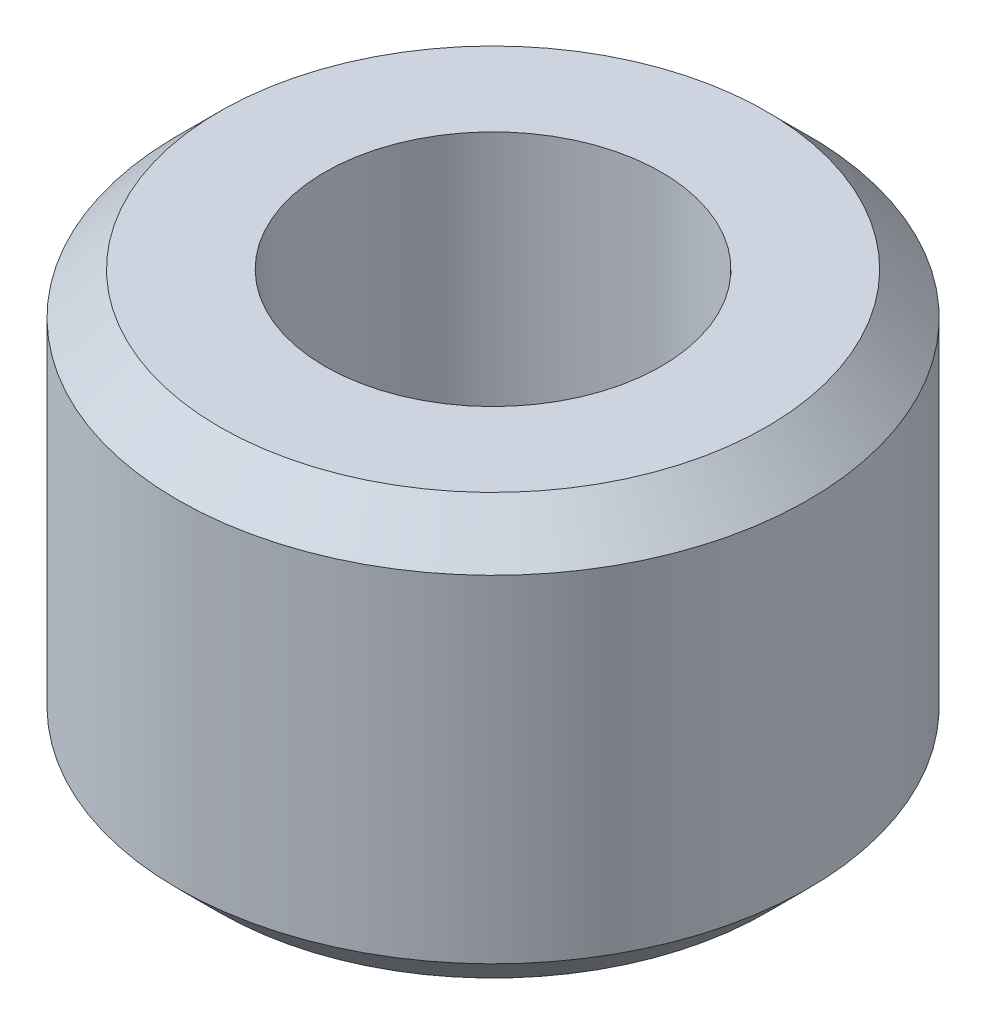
ISO-10303-21;
HEADER;
FILE_DESCRIPTION(('STEP AP214'),'2;1');
FILE_NAME('part.step','',(''),(''),'','','');
FILE_SCHEMA(('AUTOMOTIVE_DESIGN { 1 0 10303 214 1 1 1 1 }'));
ENDSEC;
DATA;
#1=APPLICATION_CONTEXT('core data for automotive mechanical design processes');
#2=APPLICATION_PROTOCOL_DEFINITION('international standard','automotive_design',2000,#1);
#3=PRODUCT_CONTEXT('',#1,'mechanical');
#4=PRODUCT('Part','Part','',(#3));
#5=PRODUCT_RELATED_PRODUCT_CATEGORY('part','',(#4));
#6=PRODUCT_DEFINITION_FORMATION('','',#4);
#7=PRODUCT_DEFINITION_CONTEXT('part definition',#1,'design');
#8=PRODUCT_DEFINITION('design','',#6,#7);
#9=PRODUCT_DEFINITION_SHAPE('','',#8);
#10=(LENGTH_UNIT() NAMED_UNIT(*) SI_UNIT(.MILLI.,.METRE.));
#11=(NAMED_UNIT(*) PLANE_ANGLE_UNIT() SI_UNIT($,.RADIAN.));
#12=(NAMED_UNIT(*) SI_UNIT($,.STERADIAN.) SOLID_ANGLE_UNIT());
#13=UNCERTAINTY_MEASURE_WITH_UNIT(LENGTH_MEASURE(1.E-05),#10,'distance_accuracy_value','');
#14=(GEOMETRIC_REPRESENTATION_CONTEXT(3) GLOBAL_UNCERTAINTY_ASSIGNED_CONTEXT((#13)) GLOBAL_UNIT_ASSIGNED_CONTEXT((#10,
#11,#12)) REPRESENTATION_CONTEXT('',''));
#15=CARTESIAN_POINT('',(0.,0.,0.));
#16=DIRECTION('',(0.,0.,1.));
#17=DIRECTION('',(1.,0.,0.));
#18=AXIS2_PLACEMENT_3D('',#15,#16,#17);
#19=CARTESIAN_POINT('',(0.,10.,0.));
#20=DIRECTION('',(0.,1.,0.));
#21=DIRECTION('',(0.,0.,1.));
#22=AXIS2_PLACEMENT_3D('',#19,#20,#21);
#23=PLANE('',#22);
#24=CARTESIAN_POINT('',(0.,10.,0.));
#25=DIRECTION('',(0.,1.,0.));
#26=DIRECTION('',(0.,0.,1.));
#27=AXIS2_PLACEMENT_3D('',#24,#25,#26);
#28=CIRCLE('',#27,6.49999999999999);
#29=CARTESIAN_POINT('',(0.,10.,6.49999999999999));
#30=VERTEX_POINT('',#29);
#31=EDGE_CURVE('E10',#30,#30,#28,.T.);
#32=ORIENTED_EDGE('',*,*,#31,.T.);
#33=EDGE_LOOP('',(#32));
#34=FACE_BOUND('',#33,.T.);
#35=CARTESIAN_POINT('',(0.,10.,0.));
#36=DIRECTION('',(0.,1.,0.));
#37=DIRECTION('',(0.,0.,1.));
#38=AXIS2_PLACEMENT_3D('',#35,#36,#37);
#39=CIRCLE('',#38,4.);
#40=CARTESIAN_POINT('',(0.,10.,4.));
#41=VERTEX_POINT('',#40);
#42=EDGE_CURVE('E50',#41,#41,#39,.T.);
#43=ORIENTED_EDGE('',*,*,#42,.F.);
#44=EDGE_LOOP('',(#43));
#45=FACE_BOUND('',#44,.T.);
#46=ADVANCED_FACE('F30',(#34,#45),#23,.T.);
#47=CARTESIAN_POINT('',(0.,0.,0.));
#48=DIRECTION('',(0.,1.,0.));
#49=DIRECTION('',(0.,0.,1.));
#50=AXIS2_PLACEMENT_3D('',#47,#48,#49);
#51=PLANE('',#50);
#52=CARTESIAN_POINT('',(0.,0.,0.));
#53=DIRECTION('',(0.,1.,0.));
#54=DIRECTION('',(0.,0.,1.));
#55=AXIS2_PLACEMENT_3D('',#52,#53,#54);
#56=CIRCLE('',#55,6.5);
#57=CARTESIAN_POINT('',(0.,0.,6.5));
#58=VERTEX_POINT('',#57);
#59=EDGE_CURVE('E37',#58,#58,#56,.F.);
#60=ORIENTED_EDGE('',*,*,#59,.T.);
#61=EDGE_LOOP('',(#60));
#62=FACE_BOUND('',#61,.T.);
#63=CARTESIAN_POINT('',(0.,0.,0.));
#64=DIRECTION('',(0.,1.,0.));
#65=DIRECTION('',(0.,0.,1.));
#66=AXIS2_PLACEMENT_3D('',#63,#64,#65);
#67=CIRCLE('',#66,4.);
#68=CARTESIAN_POINT('',(0.,0.,4.));
#69=VERTEX_POINT('',#68);
#70=EDGE_CURVE('E51',#69,#69,#67,.T.);
#71=ORIENTED_EDGE('',*,*,#70,.T.);
#72=EDGE_LOOP('',(#71));
#73=FACE_BOUND('',#72,.T.);
#74=ADVANCED_FACE('F61',(#62,#73),#51,.F.);
#75=CARTESIAN_POINT('',(0.,10.,0.));
#76=DIRECTION('',(0.,-1.,0.));
#77=DIRECTION('',(0.,0.,-1.));
#78=AXIS2_PLACEMENT_3D('',#75,#76,#77);
#79=CYLINDRICAL_SURFACE('',#78,7.5);
#80=CARTESIAN_POINT('',(0.,0.999999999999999,0.));
#81=DIRECTION('',(0.,1.,0.));
#82=DIRECTION('',(0.,0.,1.));
#83=AXIS2_PLACEMENT_3D('',#80,#81,#82);
#84=CIRCLE('',#83,7.5);
#85=CARTESIAN_POINT('',(0.,0.999999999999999,7.5));
#86=VERTEX_POINT('',#85);
#87=EDGE_CURVE('E41',#86,#86,#84,.T.);
#88=ORIENTED_EDGE('',*,*,#87,.T.);
#89=EDGE_LOOP('',(#88));
#90=FACE_BOUND('',#89,.T.);
#91=CARTESIAN_POINT('',(0.,8.99999999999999,0.));
#92=DIRECTION('',(0.,1.,0.));
#93=DIRECTION('',(0.,0.,1.));
#94=AXIS2_PLACEMENT_3D('',#91,#92,#93);
#95=CIRCLE('',#94,7.5);
#96=CARTESIAN_POINT('',(0.,8.99999999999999,7.5));
#97=VERTEX_POINT('',#96);
#98=EDGE_CURVE('E45',#97,#97,#95,.F.);
#99=ORIENTED_EDGE('',*,*,#98,.T.);
#100=EDGE_LOOP('',(#99));
#101=FACE_BOUND('',#100,.T.);
#102=ADVANCED_FACE('F66',(#90,#101),#79,.T.);
#103=CARTESIAN_POINT('',(0.,10.,0.));
#104=DIRECTION('',(0.,-1.,0.));
#105=DIRECTION('',(0.,0.,-1.));
#106=AXIS2_PLACEMENT_3D('',#103,#104,#105);
#107=CYLINDRICAL_SURFACE('',#106,4.);
#108=ORIENTED_EDGE('',*,*,#42,.T.);
#109=EDGE_LOOP('',(#108));
#110=FACE_BOUND('',#109,.T.);
#111=ORIENTED_EDGE('',*,*,#70,.F.);
#112=EDGE_LOOP('',(#111));
#113=FACE_BOUND('',#112,.T.);
#114=ADVANCED_FACE('F57',(#110,#113),#107,.F.);
#115=CARTESIAN_POINT('',(0.,0.999999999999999,0.));
#116=DIRECTION('',(0.,1.,0.));
#117=DIRECTION('',(0.,0.,1.));
#118=AXIS2_PLACEMENT_3D('',#115,#116,#117);
#119=CONICAL_SURFACE('',#118,7.5,0.78539816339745);
#120=ORIENTED_EDGE('',*,*,#59,.F.);
#121=EDGE_LOOP('',(#120));
#122=FACE_BOUND('',#121,.T.);
#123=ORIENTED_EDGE('',*,*,#87,.F.);
#124=EDGE_LOOP('',(#123));
#125=FACE_BOUND('',#124,.T.);
#126=ADVANCED_FACE('F72',(#122,#125),#119,.T.);
#127=CARTESIAN_POINT('',(0.,10.,0.));
#128=DIRECTION('',(0.,-1.,0.));
#129=DIRECTION('',(0.,0.,-1.));
#130=AXIS2_PLACEMENT_3D('',#127,#128,#129);
#131=CONICAL_SURFACE('',#130,6.49999999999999,0.785398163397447);
#132=ORIENTED_EDGE('',*,*,#98,.F.);
#133=EDGE_LOOP('',(#132));
#134=FACE_BOUND('',#133,.T.);
#135=ORIENTED_EDGE('',*,*,#31,.F.);
#136=EDGE_LOOP('',(#135));
#137=FACE_BOUND('',#136,.T.);
#138=ADVANCED_FACE('F32',(#134,#137),#131,.T.);
#139=CLOSED_SHELL('',(#46,#74,#102,#114,#126,#138));
#140=MANIFOLD_SOLID_BREP('B2',#139);
#141=ADVANCED_BREP_SHAPE_REPRESENTATION('',(#18,#140),#14);
#142=SHAPE_DEFINITION_REPRESENTATION(#9,#141);
ENDSEC;
END-ISO-10303-21;
